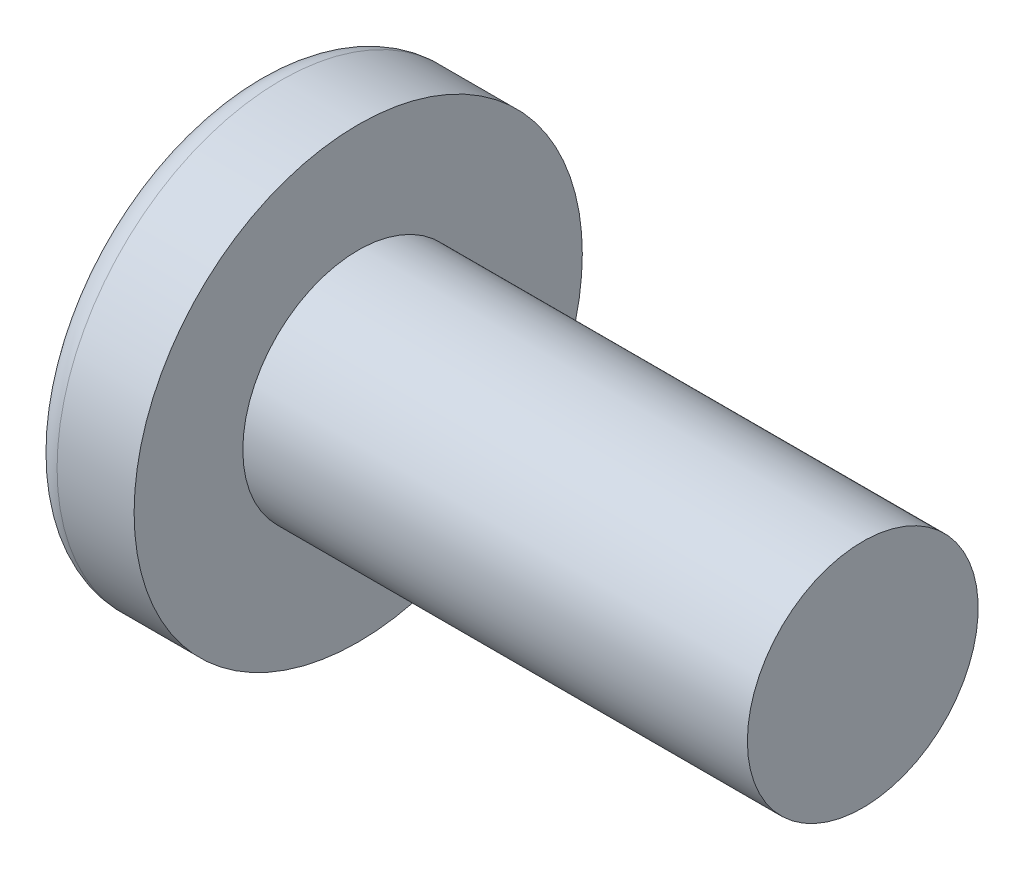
ISO-10303-21;
HEADER;
FILE_DESCRIPTION(('STEP AP214'),'2;1');
FILE_NAME('part.step','',(''),(''),'','','');
FILE_SCHEMA(('AUTOMOTIVE_DESIGN { 1 0 10303 214 1 1 1 1 }'));
ENDSEC;
DATA;
#1=APPLICATION_CONTEXT('core data for automotive mechanical design processes');
#2=APPLICATION_PROTOCOL_DEFINITION('international standard','automotive_design',2000,#1);
#3=PRODUCT_CONTEXT('',#1,'mechanical');
#4=PRODUCT('Part','Part','',(#3));
#5=PRODUCT_RELATED_PRODUCT_CATEGORY('part','',(#4));
#6=PRODUCT_DEFINITION_FORMATION('','',#4);
#7=PRODUCT_DEFINITION_CONTEXT('part definition',#1,'design');
#8=PRODUCT_DEFINITION('design','',#6,#7);
#9=PRODUCT_DEFINITION_SHAPE('','',#8);
#10=(LENGTH_UNIT() NAMED_UNIT(*) SI_UNIT(.MILLI.,.METRE.));
#11=(NAMED_UNIT(*) PLANE_ANGLE_UNIT() SI_UNIT($,.RADIAN.));
#12=(NAMED_UNIT(*) SI_UNIT($,.STERADIAN.) SOLID_ANGLE_UNIT());
#13=UNCERTAINTY_MEASURE_WITH_UNIT(LENGTH_MEASURE(1.E-05),#10,'distance_accuracy_value','');
#14=(GEOMETRIC_REPRESENTATION_CONTEXT(3) GLOBAL_UNCERTAINTY_ASSIGNED_CONTEXT((#13)) GLOBAL_UNIT_ASSIGNED_CONTEXT((#10,
#11,#12)) REPRESENTATION_CONTEXT('',''));
#15=CARTESIAN_POINT('',(0.,0.,0.));
#16=DIRECTION('',(0.,0.,1.));
#17=DIRECTION('',(1.,0.,0.));
#18=AXIS2_PLACEMENT_3D('',#15,#16,#17);
#19=CARTESIAN_POINT('',(3.49503999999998,0.,0.));
#20=DIRECTION('',(-1.,0.,0.));
#21=DIRECTION('',(0.,1.,0.));
#22=AXIS2_PLACEMENT_3D('',#19,#20,#21);
#23=SPHERICAL_SURFACE('',#22,3.49504);
#24=CARTESIAN_POINT('',(0.638066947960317,0.,0.));
#25=DIRECTION('',(-1.,0.,0.));
#26=DIRECTION('',(0.,0.,1.));
#27=AXIS2_PLACEMENT_3D('',#24,#25,#26);
#28=CIRCLE('',#27,2.01320877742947);
#29=CARTESIAN_POINT('',(0.638066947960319,0.,2.01320877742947));
#30=VERTEX_POINT('',#29);
#31=EDGE_CURVE('E152',#30,#30,#28,.T.);
#32=ORIENTED_EDGE('',*,*,#31,.T.);
#33=EDGE_LOOP('',(#32));
#34=FACE_BOUND('',#33,.T.);
#35=CARTESIAN_POINT('',(3.48860800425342,-0.0562204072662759,0.));
#36=DIRECTION('',(-0.113665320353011,-0.993519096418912,0.));
#37=DIRECTION('',(0.99351909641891,-0.113665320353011,0.));
#38=AXIS2_PLACEMENT_3D('',#35,#36,#37);
#39=CIRCLE('',#38,3.49458187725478);
#40=CARTESIAN_POINT('',(0.227775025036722,0.316840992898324,1.19995665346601));
#41=VERTEX_POINT('',#40);
#42=CARTESIAN_POINT('',(0.0330603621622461,0.339117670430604,0.339117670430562));
#43=VERTEX_POINT('',#42);
#44=EDGE_CURVE('E183',#41,#43,#39,.T.);
#45=ORIENTED_EDGE('',*,*,#44,.F.);
#46=CARTESIAN_POINT('',(2.78874832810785,0.,-0.872695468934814));
#47=DIRECTION('',(0.629103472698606,0.,0.777321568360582));
#48=DIRECTION('',(0.777321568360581,0.,-0.629103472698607));
#49=AXIS2_PLACEMENT_3D('',#46,#47,#48);
#50=CIRCLE('',#49,3.30981257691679);
#51=CARTESIAN_POINT('',(0.227775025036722,-0.316840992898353,1.19995665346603));
#52=VERTEX_POINT('',#51);
#53=EDGE_CURVE('E148',#41,#52,#50,.T.);
#54=ORIENTED_EDGE('',*,*,#53,.T.);
#55=CARTESIAN_POINT('',(3.48860800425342,0.0562204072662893,0.));
#56=DIRECTION('',(-0.113665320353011,0.993519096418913,0.));
#57=DIRECTION('',(-0.99351909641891,-0.113665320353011,0.));
#58=AXIS2_PLACEMENT_3D('',#55,#56,#57);
#59=CIRCLE('',#58,3.49458187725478);
#60=CARTESIAN_POINT('',(0.0330603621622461,-0.339117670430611,0.339117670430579));
#61=VERTEX_POINT('',#60);
#62=EDGE_CURVE('E104',#61,#52,#59,.T.);
#63=ORIENTED_EDGE('',*,*,#62,.F.);
#64=CARTESIAN_POINT('',(3.48860800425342,0.,-0.0562204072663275));
#65=DIRECTION('',(-0.113665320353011,0.,-0.99351909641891));
#66=DIRECTION('',(-0.99351909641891,0.,0.11366532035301));
#67=AXIS2_PLACEMENT_3D('',#64,#65,#66);
#68=CIRCLE('',#67,3.49458187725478);
#69=CARTESIAN_POINT('',(0.227775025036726,-1.19995665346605,0.316840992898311));
#70=VERTEX_POINT('',#69);
#71=EDGE_CURVE('E129',#70,#61,#68,.T.);
#72=ORIENTED_EDGE('',*,*,#71,.F.);
#73=CARTESIAN_POINT('',(2.78874832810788,0.87269546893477,0.));
#74=DIRECTION('',(0.629103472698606,-0.777321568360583,0.));
#75=DIRECTION('',(0.777321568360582,0.629103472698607,0.));
#76=AXIS2_PLACEMENT_3D('',#73,#74,#75);
#77=CIRCLE('',#76,3.30981257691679);
#78=CARTESIAN_POINT('',(0.227775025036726,-1.19995665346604,-0.316840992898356));
#79=VERTEX_POINT('',#78);
#80=EDGE_CURVE('E137',#70,#79,#77,.T.);
#81=ORIENTED_EDGE('',*,*,#80,.T.);
#82=CARTESIAN_POINT('',(3.48860800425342,0.,0.0562204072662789));
#83=DIRECTION('',(-0.113665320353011,0.,0.993519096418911));
#84=DIRECTION('',(0.99351909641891,0.,0.113665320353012));
#85=AXIS2_PLACEMENT_3D('',#82,#83,#84);
#86=CIRCLE('',#85,3.49458187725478);
#87=CARTESIAN_POINT('',(0.0330603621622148,-0.33911767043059,-0.339117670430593));
#88=VERTEX_POINT('',#87);
#89=EDGE_CURVE('E47',#88,#79,#86,.T.);
#90=ORIENTED_EDGE('',*,*,#89,.F.);
#91=CARTESIAN_POINT('',(0.227775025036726,-0.316840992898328,-1.19995665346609));
#92=VERTEX_POINT('',#91);
#93=EDGE_CURVE('E190',#92,#88,#59,.T.);
#94=ORIENTED_EDGE('',*,*,#93,.F.);
#95=CARTESIAN_POINT('',(2.78874832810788,0.,0.872695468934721));
#96=DIRECTION('',(0.629103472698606,0.,-0.777321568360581));
#97=DIRECTION('',(-0.777321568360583,0.,-0.629103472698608));
#98=AXIS2_PLACEMENT_3D('',#95,#96,#97);
#99=CIRCLE('',#98,3.30981257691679);
#100=CARTESIAN_POINT('',(0.227775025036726,0.31684099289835,-1.19995665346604));
#101=VERTEX_POINT('',#100);
#102=EDGE_CURVE('E130',#92,#101,#99,.T.);
#103=ORIENTED_EDGE('',*,*,#102,.T.);
#104=CARTESIAN_POINT('',(0.0330603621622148,0.339117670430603,-0.339117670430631));
#105=VERTEX_POINT('',#104);
#106=EDGE_CURVE('E178',#105,#101,#39,.T.);
#107=ORIENTED_EDGE('',*,*,#106,.F.);
#108=CARTESIAN_POINT('',(0.227775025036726,1.19995665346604,-0.316840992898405));
#109=VERTEX_POINT('',#108);
#110=EDGE_CURVE('E40',#109,#105,#86,.T.);
#111=ORIENTED_EDGE('',*,*,#110,.F.);
#112=CARTESIAN_POINT('',(2.78874832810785,-0.872695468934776,0.));
#113=DIRECTION('',(0.629103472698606,0.777321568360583,0.));
#114=DIRECTION('',(-0.777321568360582,0.629103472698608,0.));
#115=AXIS2_PLACEMENT_3D('',#112,#113,#114);
#116=CIRCLE('',#115,3.30981257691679);
#117=CARTESIAN_POINT('',(0.227775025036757,1.19995665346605,0.316840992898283));
#118=VERTEX_POINT('',#117);
#119=EDGE_CURVE('E11',#109,#118,#116,.T.);
#120=ORIENTED_EDGE('',*,*,#119,.T.);
#121=EDGE_CURVE('E166',#43,#118,#68,.T.);
#122=ORIENTED_EDGE('',*,*,#121,.F.);
#123=EDGE_LOOP('',(#45,#54,#63,#72,#81,#90,#94,#103,#107,#111,#120,#122));
#124=FACE_BOUND('',#123,.T.);
#125=ADVANCED_FACE('F32',(#34,#124),#23,.T.);
#126=CARTESIAN_POINT('',(1.71044397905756,0.,-0.147213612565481));
#127=DIRECTION('',(-0.113665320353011,0.,0.993519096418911));
#128=DIRECTION('',(0.99351909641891,0.,0.113665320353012));
#129=AXIS2_PLACEMENT_3D('',#126,#127,#128);
#130=PLANE('',#129);
#131=ORIENTED_EDGE('',*,*,#110,.T.);
#132=DIRECTION('',(0.987162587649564,-0.112938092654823,0.112938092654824));
#133=VECTOR('',#132,1.);
#134=CARTESIAN_POINT('',(1.72685656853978,0.145335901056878,-0.145335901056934));
#135=LINE('',#134,#133);
#136=CARTESIAN_POINT('',(1.49859999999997,0.17145,-0.171450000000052));
#137=VERTEX_POINT('',#136);
#138=EDGE_CURVE('E172',#105,#137,#135,.T.);
#139=ORIENTED_EDGE('',*,*,#138,.T.);
#140=DIRECTION('',(0.774265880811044,-0.62663043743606,0.0885812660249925));
#141=VECTOR('',#140,1.);
#142=CARTESIAN_POINT('',(0.,1.3843,-0.342900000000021));
#143=LINE('',#142,#141);
#144=EDGE_CURVE('E153',#109,#137,#143,.T.);
#145=ORIENTED_EDGE('',*,*,#144,.F.);
#146=EDGE_LOOP('',(#131,#139,#145));
#147=FACE_BOUND('',#146,.T.);
#148=ADVANCED_FACE('F171',(#147),#130,.T.);
#149=DIRECTION('',(0.774265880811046,0.62663043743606,0.0885812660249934));
#150=VECTOR('',#149,1.);
#151=CARTESIAN_POINT('',(0.,-1.3843,-0.3429));
#152=LINE('',#151,#150);
#153=CARTESIAN_POINT('',(1.49859999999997,-0.171449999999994,-0.171450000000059));
#154=VERTEX_POINT('',#153);
#155=EDGE_CURVE('E138',#79,#154,#152,.T.);
#156=ORIENTED_EDGE('',*,*,#155,.T.);
#157=DIRECTION('',(-0.987162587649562,-0.112938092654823,-0.112938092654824));
#158=VECTOR('',#157,1.);
#159=CARTESIAN_POINT('',(1.72685656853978,-0.145335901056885,-0.145335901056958));
#160=LINE('',#159,#158);
#161=EDGE_CURVE('E193',#154,#88,#160,.T.);
#162=ORIENTED_EDGE('',*,*,#161,.T.);
#163=ORIENTED_EDGE('',*,*,#89,.T.);
#164=EDGE_LOOP('',(#156,#162,#163));
#165=FACE_BOUND('',#164,.T.);
#166=ADVANCED_FACE('F208',(#165),#130,.T.);
#167=CARTESIAN_POINT('',(1.71044397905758,0.,0.147213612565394));
#168=DIRECTION('',(-0.113665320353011,0.,-0.99351909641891));
#169=DIRECTION('',(-0.99351909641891,0.,0.11366532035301));
#170=AXIS2_PLACEMENT_3D('',#167,#168,#169);
#171=PLANE('',#170);
#172=DIRECTION('',(0.774265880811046,-0.62663043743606,-0.0885812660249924));
#173=VECTOR('',#172,1.);
#174=CARTESIAN_POINT('',(0.,1.3843,0.342899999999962));
#175=LINE('',#174,#173);
#176=CARTESIAN_POINT('',(1.49859999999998,0.171450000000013,0.171449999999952));
#177=VERTEX_POINT('',#176);
#178=EDGE_CURVE('E209',#118,#177,#175,.T.);
#179=ORIENTED_EDGE('',*,*,#178,.T.);
#180=DIRECTION('',(-0.987162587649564,0.112938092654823,0.112938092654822));
#181=VECTOR('',#180,1.);
#182=CARTESIAN_POINT('',(1.7268565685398,0.14533590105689,0.14533590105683));
#183=LINE('',#182,#181);
#184=EDGE_CURVE('E187',#177,#43,#183,.T.);
#185=ORIENTED_EDGE('',*,*,#184,.T.);
#186=ORIENTED_EDGE('',*,*,#121,.T.);
#187=EDGE_LOOP('',(#179,#185,#186));
#188=FACE_BOUND('',#187,.T.);
#189=ADVANCED_FACE('F213',(#188),#171,.T.);
#190=ORIENTED_EDGE('',*,*,#71,.T.);
#191=DIRECTION('',(0.987162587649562,0.112938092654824,-0.112938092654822));
#192=VECTOR('',#191,1.);
#193=CARTESIAN_POINT('',(1.7268565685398,-0.145335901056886,0.145335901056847));
#194=LINE('',#193,#192);
#195=CARTESIAN_POINT('',(1.49859999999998,-0.171449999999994,0.171449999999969));
#196=VERTEX_POINT('',#195);
#197=EDGE_CURVE('E102',#61,#196,#194,.T.);
#198=ORIENTED_EDGE('',*,*,#197,.T.);
#199=DIRECTION('',(0.774265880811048,0.626630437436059,-0.0885812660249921));
#200=VECTOR('',#199,1.);
#201=CARTESIAN_POINT('',(0.,-1.3843,0.342899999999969));
#202=LINE('',#201,#200);
#203=EDGE_CURVE('E127',#70,#196,#202,.T.);
#204=ORIENTED_EDGE('',*,*,#203,.F.);
#205=EDGE_LOOP('',(#190,#198,#204));
#206=FACE_BOUND('',#205,.T.);
#207=ADVANCED_FACE('F126',(#206),#171,.T.);
#208=CARTESIAN_POINT('',(-25.3999999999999,0.,0.));
#209=DIRECTION('',(-1.,0.,0.));
#210=DIRECTION('',(0.,0.,1.));
#211=AXIS2_PLACEMENT_3D('',#208,#209,#210);
#212=CYLINDRICAL_SURFACE('',#211,1.0922);
#213=CARTESIAN_POINT('',(6.34999999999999,0.,0.));
#214=DIRECTION('',(-1.,0.,0.));
#215=DIRECTION('',(0.,0.,1.));
#216=AXIS2_PLACEMENT_3D('',#213,#214,#215);
#217=CIRCLE('',#216,1.0922);
#218=CARTESIAN_POINT('',(6.34999999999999,0.,1.09219999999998));
#219=VERTEX_POINT('',#218);
#220=EDGE_CURVE('E149',#219,#219,#217,.T.);
#221=ORIENTED_EDGE('',*,*,#220,.T.);
#222=EDGE_LOOP('',(#221));
#223=FACE_BOUND('',#222,.T.);
#224=CARTESIAN_POINT('',(1.57479999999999,0.,0.));
#225=DIRECTION('',(-1.,0.,0.));
#226=DIRECTION('',(0.,0.,1.));
#227=AXIS2_PLACEMENT_3D('',#224,#225,#226);
#228=CIRCLE('',#227,1.0922);
#229=CARTESIAN_POINT('',(1.57479999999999,0.,1.09219999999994));
#230=VERTEX_POINT('',#229);
#231=EDGE_CURVE('E162',#230,#230,#228,.T.);
#232=ORIENTED_EDGE('',*,*,#231,.F.);
#233=EDGE_LOOP('',(#232));
#234=FACE_BOUND('',#233,.T.);
#235=ADVANCED_FACE('F34',(#223,#234),#212,.T.);
#236=CARTESIAN_POINT('',(1.5748,1.0922,0.));
#237=DIRECTION('',(-1.,0.,0.));
#238=DIRECTION('',(0.,0.,1.));
#239=AXIS2_PLACEMENT_3D('',#236,#237,#238);
#240=PLANE('',#239);
#241=CARTESIAN_POINT('',(1.57479999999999,0.,0.));
#242=DIRECTION('',(-1.,0.,0.));
#243=DIRECTION('',(0.,0.,1.));
#244=AXIS2_PLACEMENT_3D('',#241,#242,#243);
#245=CIRCLE('',#244,2.1209);
#246=CARTESIAN_POINT('',(1.57479999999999,0.,2.12089999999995));
#247=VERTEX_POINT('',#246);
#248=EDGE_CURVE('E159',#247,#247,#245,.T.);
#249=ORIENTED_EDGE('',*,*,#248,.F.);
#250=EDGE_LOOP('',(#249));
#251=FACE_BOUND('',#250,.T.);
#252=ORIENTED_EDGE('',*,*,#231,.T.);
#253=EDGE_LOOP('',(#252));
#254=FACE_BOUND('',#253,.T.);
#255=ADVANCED_FACE('F241',(#251,#254),#240,.F.);
#256=CARTESIAN_POINT('',(-25.3999999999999,0.,0.));
#257=DIRECTION('',(-1.,0.,0.));
#258=DIRECTION('',(0.,0.,1.));
#259=AXIS2_PLACEMENT_3D('',#256,#257,#258);
#260=CYLINDRICAL_SURFACE('',#259,2.1209);
#261=ORIENTED_EDGE('',*,*,#248,.T.);
#262=EDGE_LOOP('',(#261));
#263=FACE_BOUND('',#262,.T.);
#264=CARTESIAN_POINT('',(0.845695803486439,0.,0.));
#265=DIRECTION('',(-1.,0.,0.));
#266=DIRECTION('',(0.,0.,1.));
#267=AXIS2_PLACEMENT_3D('',#264,#265,#266);
#268=CIRCLE('',#267,2.1209);
#269=CARTESIAN_POINT('',(0.84569580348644,0.,2.12089999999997));
#270=VERTEX_POINT('',#269);
#271=EDGE_CURVE('E156',#270,#270,#268,.T.);
#272=ORIENTED_EDGE('',*,*,#271,.F.);
#273=EDGE_LOOP('',(#272));
#274=FACE_BOUND('',#273,.T.);
#275=ADVANCED_FACE('F238',(#263,#274),#260,.T.);
#276=CARTESIAN_POINT('',(0.845695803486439,0.,0.));
#277=DIRECTION('',(-1.,0.,0.));
#278=DIRECTION('',(0.,0.,1.));
#279=AXIS2_PLACEMENT_3D('',#276,#277,#278);
#280=TOROIDAL_SURFACE('',#279,1.8669,0.254);
#281=ORIENTED_EDGE('',*,*,#271,.T.);
#282=EDGE_LOOP('',(#281));
#283=FACE_BOUND('',#282,.T.);
#284=ORIENTED_EDGE('',*,*,#31,.F.);
#285=EDGE_LOOP('',(#284));
#286=FACE_BOUND('',#285,.T.);
#287=ADVANCED_FACE('F235',(#283,#286),#280,.T.);
#288=CARTESIAN_POINT('',(6.35,1.09220000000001,0.));
#289=DIRECTION('',(1.,0.,0.));
#290=DIRECTION('',(0.,0.,-1.));
#291=AXIS2_PLACEMENT_3D('',#288,#289,#290);
#292=PLANE('',#291);
#293=ORIENTED_EDGE('',*,*,#220,.F.);
#294=EDGE_LOOP('',(#293));
#295=FACE_BOUND('',#294,.T.);
#296=ADVANCED_FACE('F233',(#295),#292,.T.);
#297=CARTESIAN_POINT('',(1.49859999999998,0.171450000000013,0.171449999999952));
#298=DIRECTION('',(0.629103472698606,0.777321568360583,0.));
#299=DIRECTION('',(-0.777321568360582,0.629103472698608,0.));
#300=AXIS2_PLACEMENT_3D('',#297,#298,#299);
#301=PLANE('',#300);
#302=ORIENTED_EDGE('',*,*,#144,.T.);
#303=DIRECTION('',(0.,0.,-1.));
#304=VECTOR('',#303,1.);
#305=CARTESIAN_POINT('',(1.49859999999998,0.171450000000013,0.171449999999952));
#306=LINE('',#305,#304);
#307=EDGE_CURVE('E120',#177,#137,#306,.T.);
#308=ORIENTED_EDGE('',*,*,#307,.F.);
#309=ORIENTED_EDGE('',*,*,#178,.F.);
#310=ORIENTED_EDGE('',*,*,#119,.F.);
#311=EDGE_LOOP('',(#302,#308,#309,#310));
#312=FACE_BOUND('',#311,.T.);
#313=ADVANCED_FACE('F212',(#312),#301,.F.);
#314=CARTESIAN_POINT('',(1.49859999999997,-0.171449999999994,-0.171450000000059));
#315=DIRECTION('',(0.629103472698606,-0.777321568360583,0.));
#316=DIRECTION('',(0.777321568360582,0.629103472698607,0.));
#317=AXIS2_PLACEMENT_3D('',#314,#315,#316);
#318=PLANE('',#317);
#319=ORIENTED_EDGE('',*,*,#203,.T.);
#320=DIRECTION('',(0.,0.,1.));
#321=VECTOR('',#320,1.);
#322=CARTESIAN_POINT('',(1.49859999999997,-0.171449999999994,-0.171450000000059));
#323=LINE('',#322,#321);
#324=EDGE_CURVE('E119',#154,#196,#323,.T.);
#325=ORIENTED_EDGE('',*,*,#324,.F.);
#326=ORIENTED_EDGE('',*,*,#155,.F.);
#327=ORIENTED_EDGE('',*,*,#80,.F.);
#328=EDGE_LOOP('',(#319,#325,#326,#327));
#329=FACE_BOUND('',#328,.T.);
#330=ADVANCED_FACE('F134',(#329),#318,.F.);
#331=CARTESIAN_POINT('',(1.49859999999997,0.17145,-0.171450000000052));
#332=DIRECTION('',(-1.,0.,0.));
#333=DIRECTION('',(0.,0.,1.));
#334=AXIS2_PLACEMENT_3D('',#331,#332,#333);
#335=PLANE('',#334);
#336=DIRECTION('',(0.,1.,0.));
#337=VECTOR('',#336,1.);
#338=CARTESIAN_POINT('',(1.49859999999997,-0.171449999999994,-0.171450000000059));
#339=LINE('',#338,#337);
#340=EDGE_CURVE('E142',#154,#137,#339,.T.);
#341=ORIENTED_EDGE('',*,*,#340,.F.);
#342=ORIENTED_EDGE('',*,*,#324,.T.);
#343=DIRECTION('',(0.,-1.,0.));
#344=VECTOR('',#343,1.);
#345=CARTESIAN_POINT('',(1.49859999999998,0.171450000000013,0.171449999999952));
#346=LINE('',#345,#344);
#347=EDGE_CURVE('E111',#177,#196,#346,.T.);
#348=ORIENTED_EDGE('',*,*,#347,.F.);
#349=ORIENTED_EDGE('',*,*,#307,.T.);
#350=EDGE_LOOP('',(#341,#342,#348,#349));
#351=FACE_BOUND('',#350,.T.);
#352=ADVANCED_FACE('F140',(#351),#335,.T.);
#353=CARTESIAN_POINT('',(1.49859999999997,0.17145,-0.171450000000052));
#354=DIRECTION('',(0.629103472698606,0.,-0.777321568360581));
#355=DIRECTION('',(0.777321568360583,0.,0.629103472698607));
#356=AXIS2_PLACEMENT_3D('',#353,#354,#355);
#357=PLANE('',#356);
#358=DIRECTION('',(0.774265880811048,0.0885812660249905,0.626630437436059));
#359=VECTOR('',#358,1.);
#360=CARTESIAN_POINT('',(0.,-0.342899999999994,-1.38430000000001));
#361=LINE('',#360,#359);
#362=EDGE_CURVE('E198',#92,#154,#361,.T.);
#363=ORIENTED_EDGE('',*,*,#362,.T.);
#364=ORIENTED_EDGE('',*,*,#340,.T.);
#365=DIRECTION('',(0.774265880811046,-0.0885812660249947,0.626630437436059));
#366=VECTOR('',#365,1.);
#367=CARTESIAN_POINT('',(0.,0.342899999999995,-1.3843));
#368=LINE('',#367,#366);
#369=EDGE_CURVE('E108',#101,#137,#368,.T.);
#370=ORIENTED_EDGE('',*,*,#369,.F.);
#371=ORIENTED_EDGE('',*,*,#102,.F.);
#372=EDGE_LOOP('',(#363,#364,#370,#371));
#373=FACE_BOUND('',#372,.T.);
#374=ADVANCED_FACE('F203',(#373),#357,.F.);
#375=CARTESIAN_POINT('',(1.71044397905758,-0.147213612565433,0.));
#376=DIRECTION('',(-0.113665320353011,0.993519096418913,0.));
#377=DIRECTION('',(-0.99351909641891,-0.113665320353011,0.));
#378=AXIS2_PLACEMENT_3D('',#375,#376,#377);
#379=PLANE('',#378);
#380=ORIENTED_EDGE('',*,*,#93,.T.);
#381=ORIENTED_EDGE('',*,*,#161,.F.);
#382=ORIENTED_EDGE('',*,*,#362,.F.);
#383=EDGE_LOOP('',(#380,#381,#382));
#384=FACE_BOUND('',#383,.T.);
#385=ADVANCED_FACE('F207',(#384),#379,.T.);
#386=CARTESIAN_POINT('',(1.71044397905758,0.147213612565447,0.));
#387=DIRECTION('',(-0.113665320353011,-0.993519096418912,0.));
#388=DIRECTION('',(0.99351909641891,-0.113665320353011,0.));
#389=AXIS2_PLACEMENT_3D('',#386,#387,#388);
#390=PLANE('',#389);
#391=ORIENTED_EDGE('',*,*,#106,.T.);
#392=ORIENTED_EDGE('',*,*,#369,.T.);
#393=ORIENTED_EDGE('',*,*,#138,.F.);
#394=EDGE_LOOP('',(#391,#392,#393));
#395=FACE_BOUND('',#394,.T.);
#396=ADVANCED_FACE('F201',(#395),#390,.T.);
#397=CARTESIAN_POINT('',(1.49859999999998,-0.171449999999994,0.171449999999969));
#398=DIRECTION('',(0.629103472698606,0.,0.777321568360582));
#399=DIRECTION('',(-0.777321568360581,0.,0.629103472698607));
#400=AXIS2_PLACEMENT_3D('',#397,#398,#399);
#401=PLANE('',#400);
#402=DIRECTION('',(0.774265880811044,-0.0885812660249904,-0.626630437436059));
#403=VECTOR('',#402,1.);
#404=CARTESIAN_POINT('',(0.,0.342899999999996,1.38429999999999));
#405=LINE('',#404,#403);
#406=EDGE_CURVE('E107',#41,#177,#405,.T.);
#407=ORIENTED_EDGE('',*,*,#406,.T.);
#408=ORIENTED_EDGE('',*,*,#347,.T.);
#409=DIRECTION('',(0.774265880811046,0.0885812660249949,-0.626630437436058));
#410=VECTOR('',#409,1.);
#411=CARTESIAN_POINT('',(0.,-0.342900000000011,1.3843));
#412=LINE('',#411,#410);
#413=EDGE_CURVE('E98',#52,#196,#412,.T.);
#414=ORIENTED_EDGE('',*,*,#413,.F.);
#415=ORIENTED_EDGE('',*,*,#53,.F.);
#416=EDGE_LOOP('',(#407,#408,#414,#415));
#417=FACE_BOUND('',#416,.T.);
#418=ADVANCED_FACE('F112',(#417),#401,.F.);
#419=ORIENTED_EDGE('',*,*,#44,.T.);
#420=ORIENTED_EDGE('',*,*,#184,.F.);
#421=ORIENTED_EDGE('',*,*,#406,.F.);
#422=EDGE_LOOP('',(#419,#420,#421));
#423=FACE_BOUND('',#422,.T.);
#424=ADVANCED_FACE('F214',(#423),#390,.T.);
#425=ORIENTED_EDGE('',*,*,#62,.T.);
#426=ORIENTED_EDGE('',*,*,#413,.T.);
#427=ORIENTED_EDGE('',*,*,#197,.F.);
#428=EDGE_LOOP('',(#425,#426,#427));
#429=FACE_BOUND('',#428,.T.);
#430=ADVANCED_FACE('F100',(#429),#379,.T.);
#431=CLOSED_SHELL('',(#125,#148,#166,#189,#207,#235,#255,#275,#287,#296,#313,#330,#352,#374,
#385,#396,#418,#424,#430));
#432=MANIFOLD_SOLID_BREP('B2',#431);
#433=ADVANCED_BREP_SHAPE_REPRESENTATION('',(#18,#432),#14);
#434=SHAPE_DEFINITION_REPRESENTATION(#9,#433);
ENDSEC;
END-ISO-10303-21;
